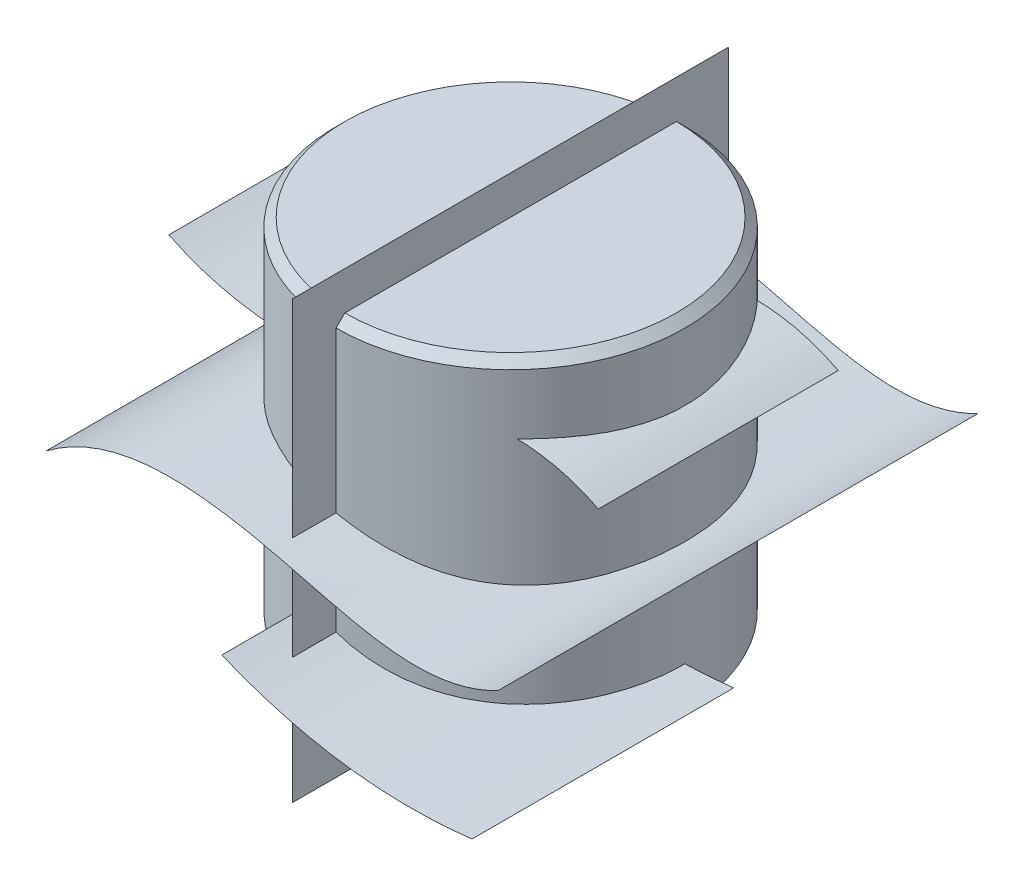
from build123d import *

# Parameters (mm, degrees)
SKETCH1_R           = 40
BOSS_EXTRUDE1_DEPTH = 80
CHAMFER1_SIZE       = 2


with BuildPart() as part:
    # Sketch1 → Boss-Extrude1 (new body)
    with BuildSketch(Plane(origin=(0, 0, 0), x_dir=(1, 0, 0), z_dir=(0, 1, 0))):
        with Locations(Location((0, 0, 0), (0, 0, 270))):
            Circle(SKETCH1_R)
    extrude(amount=BOSS_EXTRUDE1_DEPTH)

    # Chamfer1
    chamfer1_edges = [part.edges().sort_by_distance(p)[0] for p in [
        (0, 0, -40),
        (0, 80, -40),
    ]]
    chamfer(chamfer1_edges, length=CHAMFER1_SIZE)


solid = part.part
